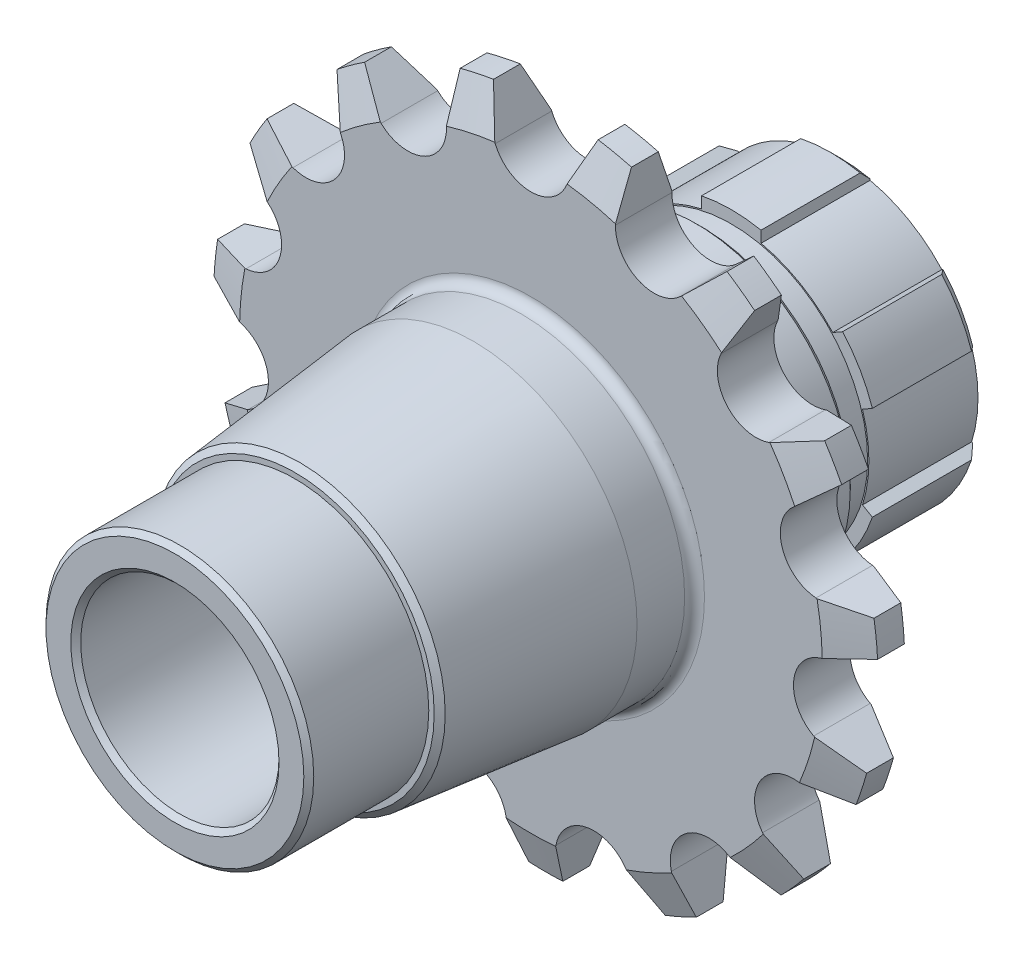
from build123d import *

# Parameters (mm, degrees)
SKETCH_1_R               = 15
EXTRUDE_1_DEPTH          = 14
SKETCH_2_OUTSIDE_W       = 40.936
SKETCH_2_OUTSIDE_H       = 40.936
SKETCH_2_OUTSIDE_R       = 13.75
CUT_EXTRUDE_1_DEPTH      = 3
SKETCH_3_R               = 15.5
EXTRUDE_2_DEPTH          = 11.5
SKETCH_4_R               = 16.5
EXTRUDE_4_DEPTH          = 29.5
CHAMFER_1_SIZE           = 18
CHAMFER_1_SIZE2          = 1.891876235
SKETCH_5_R               = 13.5
EXTRUDE_5_DEPTH          = 12.1
SKETCH_6_R               = 10
CUT_EXTRUDE_2_DEPTH      = 72.041607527
CUT_EXTRUDE_START        = -16.5
SKETCH_7_R               = 10.5
CUT_EXTRUDE_3_DEPTH      = 34.1
CHAMFER_2_SIZE           = 1
CHAMFER_3_SIZE           = 0.5
CHAMFER_4_SIZE           = 0.5
CHAMFER_5_SIZE           = 0.5
CHAMFER_6_SIZE           = 0.5
CHAMFER_6_SIZE2          = 0.561801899
CUT_EXTRUDE_4_DEPTH      = 11
PATTERN_CIRCULAR_1_COUNT = 6
SKETCH_9_R               = 33.5
SKETCH_9_R_2             = 16.5
EXTRUDE_6_DEPTH          = 5.7
CHAMFER_7_SIZE           = 1.5
CHAMFER_7_SIZE2          = 4.121216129
CUT_EXTRUDE_5_DEPTH      = 64.048076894
PATTERN_CIRCULAR_2_COUNT = 15
FILLET_1_R               = 1
FILLET_3_R               = 1


with BuildPart() as part:
    # Sketch 1 → Extrude 1 (new body)
    with BuildSketch(Plane.XY):
        Circle(SKETCH_1_R)
    extrude(amount=EXTRUDE_1_DEPTH)

    # Sketch 2 outside → Cut-Extrude 1 (cut)
    with BuildSketch(Plane.XY.offset(14)):
        Rectangle(SKETCH_2_OUTSIDE_W, SKETCH_2_OUTSIDE_H)
        Circle(SKETCH_2_OUTSIDE_R, mode=Mode.SUBTRACT)
    extrude(amount=-CUT_EXTRUDE_1_DEPTH, mode=Mode.SUBTRACT)

    # Sketch 3 → Extrude 2 (add)
    with BuildSketch(Plane.XY.offset(14)):
        Circle(SKETCH_3_R)
    extrude(amount=EXTRUDE_2_DEPTH)

    # Sketch 4 → Extrude 4 (add)
    with BuildSketch(Plane.XY.offset(25.5)):
        Circle(SKETCH_4_R)
    extrude(amount=EXTRUDE_4_DEPTH)

    # Chamfer 1
    chamfer_1_edges = [part.edges().sort_by_distance(p)[0] for p in [
        (-16.5, 0, 55),
    ]]
    chamfer_1_side = [part.faces().sort_by_distance(p)[0] for p in [
        (-16.5, 0, 40.25),
    ]]
    chamfer(chamfer_1_edges, length=CHAMFER_1_SIZE, length2=CHAMFER_1_SIZE2, reference=chamfer_1_side[0])

    # Sketch 5 → Extrude 5 (add)
    with BuildSketch(Plane.XY.offset(55)):
        Circle(SKETCH_5_R)
    extrude(amount=EXTRUDE_5_DEPTH)

    # Sketch 6 → Cut-Extrude 2 (cut, through all)
    with BuildSketch(Plane.XY.offset(67.1)):
        Circle(SKETCH_6_R)
    extrude(amount=-CUT_EXTRUDE_2_DEPTH, mode=Mode.SUBTRACT)

    # Sketch 7 → Cut-Extrude 3 (cut)
    with BuildSketch(Plane.XY.offset(67.1).offset(CUT_EXTRUDE_START)):
        Circle(SKETCH_7_R)
    extrude(amount=-CUT_EXTRUDE_3_DEPTH, mode=Mode.SUBTRACT)

    # Chamfer 2
    chamfer_2_edges = [part.edges().sort_by_distance(p)[0] for p in [
        (-15, 0, 0),
    ]]
    chamfer(chamfer_2_edges, length=CHAMFER_2_SIZE)

    # Chamfer 3
    chamfer_3_edges = [part.edges().sort_by_distance(p)[0] for p in [
        (-15.5, 0, 14),
    ]]
    chamfer(chamfer_3_edges, length=CHAMFER_3_SIZE)

    # Chamfer 4
    chamfer_4_edges = [part.edges().sort_by_distance(p)[0] for p in [
        (-10, 0, 0),
    ]]
    chamfer(chamfer_4_edges, length=CHAMFER_4_SIZE)

    # Chamfer 5
    chamfer_5_edges = [part.edges().sort_by_distance(p)[0] for p in [
        (-13.5, 0, 67.1),
        (-10, 0, 67.1),
    ]]
    chamfer(chamfer_5_edges, length=CHAMFER_5_SIZE)

    # Chamfer 6
    chamfer_6_edges = [part.edges().sort_by_distance(p)[0] for p in [
        (-14.608123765, 0, 55),
    ]]
    chamfer_6_side = [part.faces().sort_by_distance(p)[0] for p in [
        (-15.554061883, 0, 46),
    ]]
    chamfer(chamfer_6_edges, length=CHAMFER_6_SIZE, length2=CHAMFER_6_SIZE2, reference=chamfer_6_side[0])

    # Sketch 8 → Cut-Extrude 4 (cut)
    with BuildSketch(Plane(origin=(0, 0, 0), x_dir=(-1, 0, 0), z_dir=(0, 0, -1))):
        with BuildLine():
            Line((3, 19.376141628), (3, 13.551914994))
            ThreePointArc((3, 13.551914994), (6.94, 12.020432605), (10.236302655, 9.374033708))
            Line((10.236302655, 9.374033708), (14.451440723, 11.807644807))
            Line((14.451440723, 11.807644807), (3, 19.376141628))
        make_face()
    cut_extrude_4 = extrude(amount=-CUT_EXTRUDE_4_DEPTH, mode=Mode.SUBTRACT)

    # Pattern Circular 1: Cut-Extrude 4 ×6 about axis
    pattern_circular_1_axis = Axis((0, 0, 0), (0, 0, 1))
    for i in range(1, PATTERN_CIRCULAR_1_COUNT):
        add(cut_extrude_4.rotate(pattern_circular_1_axis, i * 360 / PATTERN_CIRCULAR_1_COUNT), mode=Mode.SUBTRACT)

    # Sketch 9 → Extrude 6 (add)
    with BuildSketch(Plane(origin=(0, 0, 25.5), x_dir=(-1, 0, 0), z_dir=(0, 0, -1))):
        Circle(SKETCH_9_R)
        Circle(SKETCH_9_R_2, mode=Mode.SUBTRACT)
    extrude(amount=-EXTRUDE_6_DEPTH)

    # Chamfer 7
    chamfer_7_edges = [part.edges().sort_by_distance(p)[0] for p in [
        (33.5, 0, 31.2),
        (33.5, 0, 25.5),
    ]]
    chamfer_7_side = [part.faces().sort_by_distance(p)[0] for p in [
        (33.5, 0, 28.35),
    ]]
    chamfer(chamfer_7_edges, length=CHAMFER_7_SIZE, length2=CHAMFER_7_SIZE2, reference=chamfer_7_side[0])

    # Sketch 10 → Cut-Extrude 5 (cut, through all)
    with BuildSketch(Plane(origin=(0, 0, 25.5), x_dir=(-1, 0, 0), z_dir=(0, 0, -1))):
        with BuildLine():
            Line((3.603130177, 29.047534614), (5.274339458, 33.082190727))
            ThreePointArc((5.274339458, 33.082190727), (0, 33.5), (-5.274339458, 33.082190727))
            Line((-5.274339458, 33.082190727), (-3.603130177, 29.047534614))
            ThreePointArc((-3.603130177, 29.047534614), (0, 26.64), (3.603130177, 29.047534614))
        make_face()
    cut_extrude_5 = extrude(amount=-CUT_EXTRUDE_5_DEPTH, mode=Mode.SUBTRACT)

    # Pattern Circular 2: Cut-Extrude 5 ×15 about axis
    pattern_circular_2_axis = Axis((0, 0, 0), (0, 0, 1))
    for i in range(1, PATTERN_CIRCULAR_2_COUNT):
        add(cut_extrude_5.rotate(pattern_circular_2_axis, i * 360 / PATTERN_CIRCULAR_2_COUNT), mode=Mode.SUBTRACT)

    # Fillet 1
    fillet_1_edges = [part.edges().sort_by_distance(p)[0] for p in [
        (-15.5, 0, 25.5),
    ]]
    fillet(fillet_1_edges, radius=FILLET_1_R)

    # Fillet 3
    fillet_3_edges = [part.edges().sort_by_distance(p)[0] for p in [
        (-16.5, 0, 31.2),
    ]]
    fillet(fillet_3_edges, radius=FILLET_3_R)


solid = part.part
